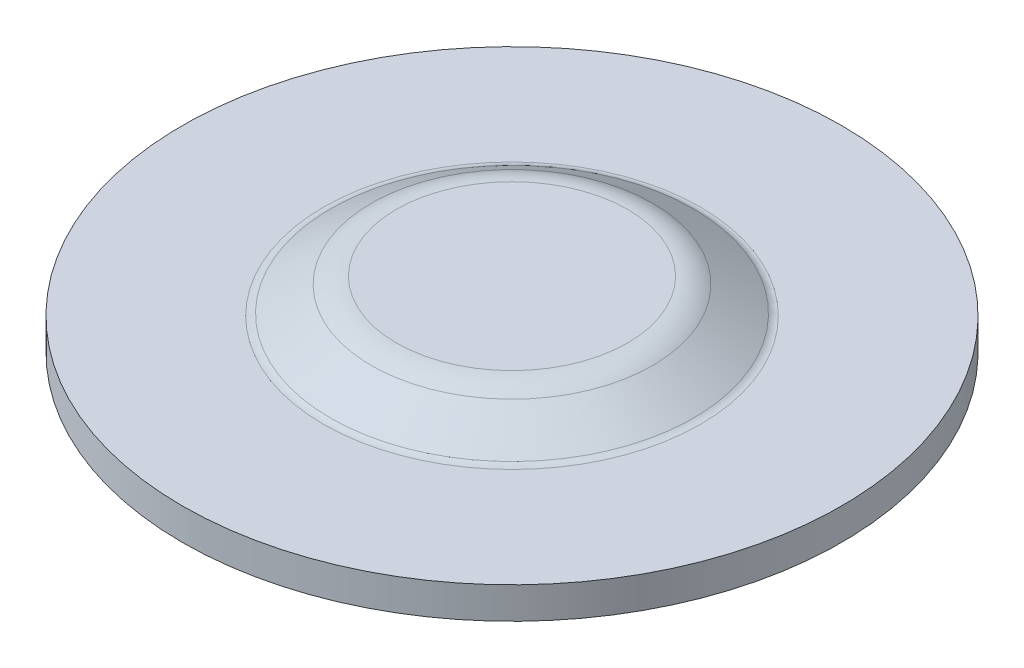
ISO-10303-21;
HEADER;
FILE_DESCRIPTION(('STEP AP214'),'2;1');
FILE_NAME('part.step','',(''),(''),'','','');
FILE_SCHEMA(('AUTOMOTIVE_DESIGN { 1 0 10303 214 1 1 1 1 }'));
ENDSEC;
DATA;
#1=APPLICATION_CONTEXT('core data for automotive mechanical design processes');
#2=APPLICATION_PROTOCOL_DEFINITION('international standard','automotive_design',2000,#1);
#3=PRODUCT_CONTEXT('',#1,'mechanical');
#4=PRODUCT('Part','Part','',(#3));
#5=PRODUCT_RELATED_PRODUCT_CATEGORY('part','',(#4));
#6=PRODUCT_DEFINITION_FORMATION('','',#4);
#7=PRODUCT_DEFINITION_CONTEXT('part definition',#1,'design');
#8=PRODUCT_DEFINITION('design','',#6,#7);
#9=PRODUCT_DEFINITION_SHAPE('','',#8);
#10=(LENGTH_UNIT() NAMED_UNIT(*) SI_UNIT(.MILLI.,.METRE.));
#11=(NAMED_UNIT(*) PLANE_ANGLE_UNIT() SI_UNIT($,.RADIAN.));
#12=(NAMED_UNIT(*) SI_UNIT($,.STERADIAN.) SOLID_ANGLE_UNIT());
#13=UNCERTAINTY_MEASURE_WITH_UNIT(LENGTH_MEASURE(1.E-05),#10,'distance_accuracy_value','');
#14=(GEOMETRIC_REPRESENTATION_CONTEXT(3) GLOBAL_UNCERTAINTY_ASSIGNED_CONTEXT((#13)) GLOBAL_UNIT_ASSIGNED_CONTEXT((#10,
#11,#12)) REPRESENTATION_CONTEXT('',''));
#15=CARTESIAN_POINT('',(0.,0.,0.));
#16=DIRECTION('',(0.,0.,1.));
#17=DIRECTION('',(1.,0.,0.));
#18=AXIS2_PLACEMENT_3D('',#15,#16,#17);
#19=CARTESIAN_POINT('',(-6.223,1.651,0.));
#20=DIRECTION('',(0.,1.,0.));
#21=DIRECTION('',(0.,0.,1.));
#22=AXIS2_PLACEMENT_3D('',#19,#20,#21);
#23=PLANE('',#22);
#24=CARTESIAN_POINT('',(0.,1.651,0.));
#25=DIRECTION('',(0.,-1.,0.));
#26=DIRECTION('',(0.,0.,-1.));
#27=AXIS2_PLACEMENT_3D('',#24,#25,#26);
#28=CIRCLE('',#27,5.57268961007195);
#29=CARTESIAN_POINT('',(0.,1.651,-5.57268961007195));
#30=VERTEX_POINT('',#29);
#31=CARTESIAN_POINT('',(0.,1.651,5.57268961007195));
#32=VERTEX_POINT('',#31);
#33=EDGE_CURVE('E59',#30,#32,#28,.T.);
#34=ORIENTED_EDGE('',*,*,#33,.F.);
#35=CARTESIAN_POINT('',(0.,1.651,0.));
#36=DIRECTION('',(0.,-1.,0.));
#37=DIRECTION('',(0.,0.,1.));
#38=AXIS2_PLACEMENT_3D('',#35,#36,#37);
#39=CIRCLE('',#38,5.57268961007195);
#40=EDGE_CURVE('E57',#32,#30,#39,.T.);
#41=ORIENTED_EDGE('',*,*,#40,.F.);
#42=EDGE_LOOP('',(#34,#41));
#43=FACE_BOUND('',#42,.T.);
#44=ADVANCED_FACE('F18',(#43),#23,.T.);
#45=CARTESIAN_POINT('',(0.,-0.634999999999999,0.));
#46=DIRECTION('',(0.,1.,0.));
#47=DIRECTION('',(0.,0.,1.));
#48=AXIS2_PLACEMENT_3D('',#45,#46,#47);
#49=TOROIDAL_SURFACE('',#48,5.57268961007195,2.286);
#50=ORIENTED_EDGE('',*,*,#40,.T.);
#51=ORIENTED_EDGE('',*,*,#33,.T.);
#52=EDGE_LOOP('',(#50,#51));
#53=FACE_BOUND('',#52,.T.);
#54=CARTESIAN_POINT('',(0.,1.30870612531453,0.));
#55=DIRECTION('',(0.,-1.,0.));
#56=DIRECTION('',(0.,0.,-1.));
#57=AXIS2_PLACEMENT_3D('',#54,#55,#56);
#58=CIRCLE('',#57,6.77593625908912);
#59=CARTESIAN_POINT('',(0.,1.30870612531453,-6.77593625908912));
#60=VERTEX_POINT('',#59);
#61=EDGE_CURVE('E65',#60,#60,#58,.T.);
#62=ORIENTED_EDGE('',*,*,#61,.F.);
#63=EDGE_LOOP('',(#62));
#64=FACE_BOUND('',#63,.T.);
#65=ADVANCED_FACE('F61',(#53,#64),#49,.T.);
#66=CARTESIAN_POINT('',(-6.223,0.127000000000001,0.));
#67=DIRECTION('',(0.,1.,0.));
#68=DIRECTION('',(0.,0.,1.));
#69=AXIS2_PLACEMENT_3D('',#66,#67,#68);
#70=PLANE('',#69);
#71=CARTESIAN_POINT('',(0.,0.127000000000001,0.));
#72=DIRECTION('',(0.,1.,0.));
#73=DIRECTION('',(0.,0.,-1.));
#74=AXIS2_PLACEMENT_3D('',#71,#72,#73);
#75=CIRCLE('',#74,5.57268961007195);
#76=CARTESIAN_POINT('',(0.,0.127000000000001,5.57268961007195));
#77=VERTEX_POINT('',#76);
#78=CARTESIAN_POINT('',(0.,0.127000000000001,-5.57268961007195));
#79=VERTEX_POINT('',#78);
#80=EDGE_CURVE('E209',#77,#79,#75,.F.);
#81=ORIENTED_EDGE('',*,*,#80,.T.);
#82=CARTESIAN_POINT('',(0.,0.127000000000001,0.));
#83=DIRECTION('',(0.,1.,0.));
#84=DIRECTION('',(0.,0.,1.));
#85=AXIS2_PLACEMENT_3D('',#82,#83,#84);
#86=CIRCLE('',#85,5.57268961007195);
#87=EDGE_CURVE('E199',#79,#77,#86,.F.);
#88=ORIENTED_EDGE('',*,*,#87,.T.);
#89=EDGE_LOOP('',(#81,#88));
#90=FACE_BOUND('',#89,.T.);
#91=ADVANCED_FACE('F91',(#90),#70,.F.);
#92=CARTESIAN_POINT('',(0.,0.095081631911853,0.));
#93=DIRECTION('',(0.,-1.,0.));
#94=DIRECTION('',(0.,0.,-1.));
#95=AXIS2_PLACEMENT_3D('',#92,#93,#94);
#96=CONICAL_SURFACE('',#95,8.73640659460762,1.01648883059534);
#97=CARTESIAN_POINT('',(0.,0.0950816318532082,0.));
#98=DIRECTION('',(0.,1.,0.));
#99=DIRECTION('',(0.,0.,1.));
#100=AXIS2_PLACEMENT_3D('',#97,#98,#99);
#101=CIRCLE('',#100,8.73640659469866);
#102=CARTESIAN_POINT('',(0.,0.0950816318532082,8.73640659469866));
#103=VERTEX_POINT('',#102);
#104=EDGE_CURVE('E214',#103,#103,#101,.T.);
#105=ORIENTED_EDGE('',*,*,#104,.T.);
#106=EDGE_LOOP('',(#105));
#107=FACE_BOUND('',#106,.T.);
#108=ORIENTED_EDGE('',*,*,#61,.T.);
#109=EDGE_LOOP('',(#108));
#110=FACE_BOUND('',#109,.T.);
#111=ADVANCED_FACE('F309',(#107,#110),#96,.T.);
#112=CARTESIAN_POINT('',(0.,-0.634999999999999,0.));
#113=DIRECTION('',(0.,1.,0.));
#114=DIRECTION('',(0.,0.,1.));
#115=AXIS2_PLACEMENT_3D('',#112,#113,#114);
#116=TOROIDAL_SURFACE('',#115,5.57268961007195,0.762);
#117=ORIENTED_EDGE('',*,*,#80,.F.);
#118=ORIENTED_EDGE('',*,*,#87,.F.);
#119=EDGE_LOOP('',(#117,#118));
#120=FACE_BOUND('',#119,.T.);
#121=CARTESIAN_POINT('',(0.,0.0129020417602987,0.));
#122=DIRECTION('',(0.,-1.,0.));
#123=DIRECTION('',(0.,0.,-1.));
#124=AXIS2_PLACEMENT_3D('',#121,#122,#123);
#125=CIRCLE('',#124,5.97377182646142);
#126=CARTESIAN_POINT('',(0.,0.0129020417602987,-5.97377182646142));
#127=VERTEX_POINT('',#126);
#128=EDGE_CURVE('E241',#127,#127,#125,.T.);
#129=ORIENTED_EDGE('',*,*,#128,.T.);
#130=EDGE_LOOP('',(#129));
#131=FACE_BOUND('',#130,.T.);
#132=ADVANCED_FACE('F181',(#120,#131),#116,.F.);
#133=CARTESIAN_POINT('',(0.,0.635,0.));
#134=DIRECTION('',(0.,1.,0.));
#135=DIRECTION('',(0.,0.,1.));
#136=AXIS2_PLACEMENT_3D('',#133,#134,#135);
#137=TOROIDAL_SURFACE('',#136,9.07064177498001,0.635);
#138=ORIENTED_EDGE('',*,*,#104,.F.);
#139=EDGE_LOOP('',(#138));
#140=FACE_BOUND('',#139,.T.);
#141=CARTESIAN_POINT('',(0.,0.,0.));
#142=DIRECTION('',(0.,1.,0.));
#143=DIRECTION('',(0.,0.,-1.));
#144=AXIS2_PLACEMENT_3D('',#141,#142,#143);
#145=CIRCLE('',#144,9.07064177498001);
#146=CARTESIAN_POINT('',(0.,0.,9.07064177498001));
#147=VERTEX_POINT('',#146);
#148=CARTESIAN_POINT('',(0.,0.,-9.07064177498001));
#149=VERTEX_POINT('',#148);
#150=EDGE_CURVE('E150',#147,#149,#145,.F.);
#151=ORIENTED_EDGE('',*,*,#150,.F.);
#152=CARTESIAN_POINT('',(0.,0.,0.));
#153=DIRECTION('',(0.,1.,0.));
#154=DIRECTION('',(0.,0.,1.));
#155=AXIS2_PLACEMENT_3D('',#152,#153,#154);
#156=CIRCLE('',#155,9.07064177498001);
#157=EDGE_CURVE('E161',#149,#147,#156,.F.);
#158=ORIENTED_EDGE('',*,*,#157,.F.);
#159=EDGE_LOOP('',(#151,#158));
#160=FACE_BOUND('',#159,.T.);
#161=ADVANCED_FACE('F176',(#140,#160),#137,.F.);
#162=CARTESIAN_POINT('',(0.,-1.20072245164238,0.));
#163=DIRECTION('',(0.,-1.,0.));
#164=DIRECTION('',(0.,0.,-1.));
#165=AXIS2_PLACEMENT_3D('',#162,#163,#164);
#166=CONICAL_SURFACE('',#165,7.93424216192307,1.01648883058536);
#167=CARTESIAN_POINT('',(0.,-1.20072245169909,0.));
#168=DIRECTION('',(0.,1.,0.));
#169=DIRECTION('',(0.,0.,1.));
#170=AXIS2_PLACEMENT_3D('',#167,#168,#169);
#171=CIRCLE('',#170,7.93424216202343);
#172=CARTESIAN_POINT('',(0.,-1.20072245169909,7.93424216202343));
#173=VERTEX_POINT('',#172);
#174=EDGE_CURVE('E107',#173,#173,#171,.T.);
#175=ORIENTED_EDGE('',*,*,#174,.F.);
#176=EDGE_LOOP('',(#175));
#177=FACE_BOUND('',#176,.T.);
#178=ORIENTED_EDGE('',*,*,#128,.F.);
#179=EDGE_LOOP('',(#178));
#180=FACE_BOUND('',#179,.T.);
#181=ADVANCED_FACE('F180',(#177,#180),#166,.F.);
#182=CARTESIAN_POINT('',(-15.875,0.,0.));
#183=DIRECTION('',(0.,1.,0.));
#184=DIRECTION('',(0.,0.,1.));
#185=AXIS2_PLACEMENT_3D('',#182,#183,#184);
#186=PLANE('',#185);
#187=CARTESIAN_POINT('',(0.,0.,0.));
#188=DIRECTION('',(0.,1.,0.));
#189=DIRECTION('',(0.,0.,1.));
#190=AXIS2_PLACEMENT_3D('',#187,#188,#189);
#191=CIRCLE('',#190,15.875);
#192=CARTESIAN_POINT('',(0.,0.,15.875));
#193=VERTEX_POINT('',#192);
#194=EDGE_CURVE('E103',#193,#193,#191,.F.);
#195=ORIENTED_EDGE('',*,*,#194,.F.);
#196=EDGE_LOOP('',(#195));
#197=FACE_BOUND('',#196,.T.);
#198=ORIENTED_EDGE('',*,*,#150,.T.);
#199=ORIENTED_EDGE('',*,*,#157,.T.);
#200=EDGE_LOOP('',(#198,#199));
#201=FACE_BOUND('',#200,.T.);
#202=ADVANCED_FACE('F128',(#197,#201),#186,.T.);
#203=CARTESIAN_POINT('',(0.,0.635,0.));
#204=DIRECTION('',(0.,1.,0.));
#205=DIRECTION('',(0.,0.,1.));
#206=AXIS2_PLACEMENT_3D('',#203,#204,#205);
#207=TOROIDAL_SURFACE('',#206,9.07064177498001,2.159);
#208=ORIENTED_EDGE('',*,*,#174,.T.);
#209=EDGE_LOOP('',(#208));
#210=FACE_BOUND('',#209,.T.);
#211=CARTESIAN_POINT('',(0.,-1.524,0.));
#212=DIRECTION('',(0.,-1.,0.));
#213=DIRECTION('',(0.,0.,1.));
#214=AXIS2_PLACEMENT_3D('',#211,#212,#213);
#215=CIRCLE('',#214,9.07064177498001);
#216=CARTESIAN_POINT('',(0.,-1.524,9.07064177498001));
#217=VERTEX_POINT('',#216);
#218=CARTESIAN_POINT('',(0.,-1.524,-9.07064177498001));
#219=VERTEX_POINT('',#218);
#220=EDGE_CURVE('E29',#217,#219,#215,.T.);
#221=ORIENTED_EDGE('',*,*,#220,.T.);
#222=CARTESIAN_POINT('',(0.,-1.524,0.));
#223=DIRECTION('',(0.,-1.,0.));
#224=DIRECTION('',(0.,0.,-1.));
#225=AXIS2_PLACEMENT_3D('',#222,#223,#224);
#226=CIRCLE('',#225,9.07064177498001);
#227=EDGE_CURVE('E106',#219,#217,#226,.T.);
#228=ORIENTED_EDGE('',*,*,#227,.T.);
#229=EDGE_LOOP('',(#221,#228));
#230=FACE_BOUND('',#229,.T.);
#231=ADVANCED_FACE('F116',(#210,#230),#207,.T.);
#232=CARTESIAN_POINT('',(0.,0.,0.));
#233=DIRECTION('',(0.,1.,0.));
#234=DIRECTION('',(0.,0.,1.));
#235=AXIS2_PLACEMENT_3D('',#232,#233,#234);
#236=CYLINDRICAL_SURFACE('',#235,15.875);
#237=ORIENTED_EDGE('',*,*,#194,.T.);
#238=EDGE_LOOP('',(#237));
#239=FACE_BOUND('',#238,.T.);
#240=CARTESIAN_POINT('',(0.,-1.524,0.));
#241=DIRECTION('',(0.,1.,0.));
#242=DIRECTION('',(0.,0.,1.));
#243=AXIS2_PLACEMENT_3D('',#240,#241,#242);
#244=CIRCLE('',#243,15.875);
#245=CARTESIAN_POINT('',(0.,-1.524,15.875));
#246=VERTEX_POINT('',#245);
#247=EDGE_CURVE('E11',#246,#246,#244,.T.);
#248=ORIENTED_EDGE('',*,*,#247,.T.);
#249=EDGE_LOOP('',(#248));
#250=FACE_BOUND('',#249,.T.);
#251=ADVANCED_FACE('F127',(#239,#250),#236,.T.);
#252=CARTESIAN_POINT('',(-15.875,-1.524,0.));
#253=DIRECTION('',(0.,1.,0.));
#254=DIRECTION('',(0.,0.,1.));
#255=AXIS2_PLACEMENT_3D('',#252,#253,#254);
#256=PLANE('',#255);
#257=ORIENTED_EDGE('',*,*,#247,.F.);
#258=EDGE_LOOP('',(#257));
#259=FACE_BOUND('',#258,.T.);
#260=ORIENTED_EDGE('',*,*,#227,.F.);
#261=ORIENTED_EDGE('',*,*,#220,.F.);
#262=EDGE_LOOP('',(#260,#261));
#263=FACE_BOUND('',#262,.T.);
#264=ADVANCED_FACE('F254',(#259,#263),#256,.F.);
#265=CLOSED_SHELL('',(#44,#65,#91,#111,#132,#161,#181,#202,#231,#251,#264));
#266=MANIFOLD_SOLID_BREP('B1',#265);
#267=ADVANCED_BREP_SHAPE_REPRESENTATION('',(#18,#266),#14);
#268=SHAPE_DEFINITION_REPRESENTATION(#9,#267);
ENDSEC;
END-ISO-10303-21;
